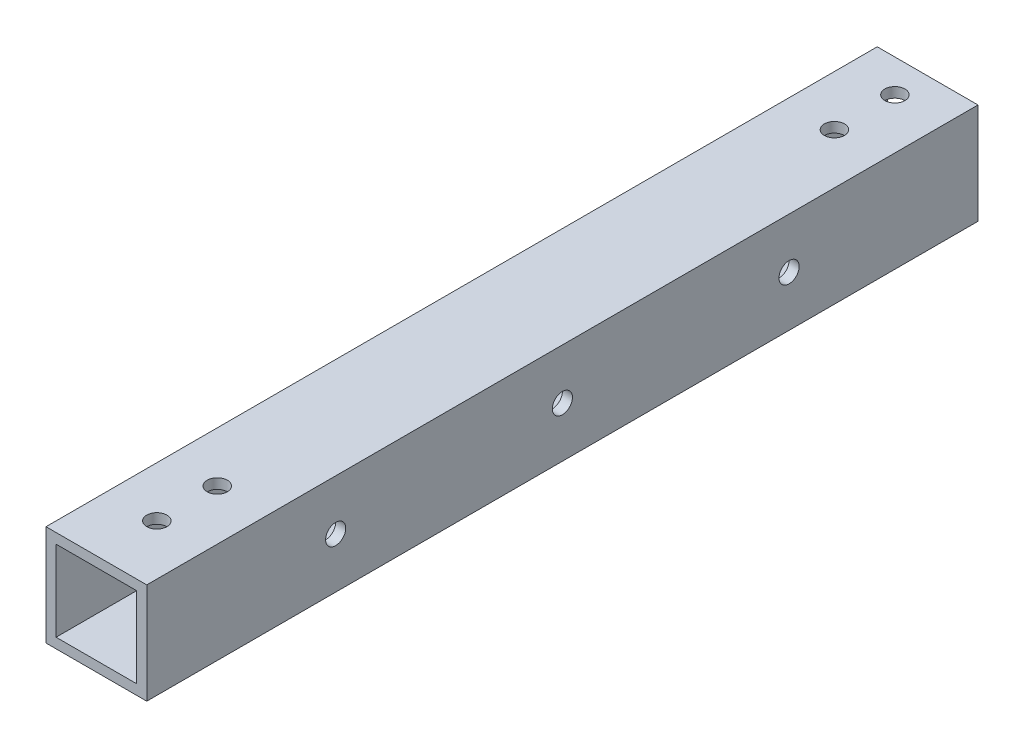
ISO-10303-21;
HEADER;
FILE_DESCRIPTION(('STEP AP214'),'2;1');
FILE_NAME('part.step','',(''),(''),'','','');
FILE_SCHEMA(('AUTOMOTIVE_DESIGN { 1 0 10303 214 1 1 1 1 }'));
ENDSEC;
DATA;
#1=APPLICATION_CONTEXT('core data for automotive mechanical design processes');
#2=APPLICATION_PROTOCOL_DEFINITION('international standard','automotive_design',2000,#1);
#3=PRODUCT_CONTEXT('',#1,'mechanical');
#4=PRODUCT('Part','Part','',(#3));
#5=PRODUCT_RELATED_PRODUCT_CATEGORY('part','',(#4));
#6=PRODUCT_DEFINITION_FORMATION('','',#4);
#7=PRODUCT_DEFINITION_CONTEXT('part definition',#1,'design');
#8=PRODUCT_DEFINITION('design','',#6,#7);
#9=PRODUCT_DEFINITION_SHAPE('','',#8);
#10=(LENGTH_UNIT() NAMED_UNIT(*) SI_UNIT(.MILLI.,.METRE.));
#11=(NAMED_UNIT(*) PLANE_ANGLE_UNIT() SI_UNIT($,.RADIAN.));
#12=(NAMED_UNIT(*) SI_UNIT($,.STERADIAN.) SOLID_ANGLE_UNIT());
#13=UNCERTAINTY_MEASURE_WITH_UNIT(LENGTH_MEASURE(1.E-05),#10,'distance_accuracy_value','');
#14=(GEOMETRIC_REPRESENTATION_CONTEXT(3) GLOBAL_UNCERTAINTY_ASSIGNED_CONTEXT((#13)) GLOBAL_UNIT_ASSIGNED_CONTEXT((#10,
#11,#12)) REPRESENTATION_CONTEXT('',''));
#15=CARTESIAN_POINT('',(0.,0.,0.));
#16=DIRECTION('',(0.,0.,1.));
#17=DIRECTION('',(1.,0.,0.));
#18=AXIS2_PLACEMENT_3D('',#15,#16,#17);
#19=CARTESIAN_POINT('',(0.,0.,165.));
#20=DIRECTION('',(0.,0.,1.));
#21=DIRECTION('',(1.,0.,0.));
#22=AXIS2_PLACEMENT_3D('',#19,#20,#21);
#23=PLANE('',#22);
#24=DIRECTION('',(0.,1.,0.));
#25=VECTOR('',#24,1.);
#26=CARTESIAN_POINT('',(10.,10.,165.));
#27=LINE('',#26,#25);
#28=CARTESIAN_POINT('',(10.,-10.,165.));
#29=VERTEX_POINT('',#28);
#30=CARTESIAN_POINT('',(10.,10.,165.));
#31=VERTEX_POINT('',#30);
#32=EDGE_CURVE('E140',#29,#31,#27,.T.);
#33=ORIENTED_EDGE('',*,*,#32,.T.);
#34=DIRECTION('',(-1.,0.,0.));
#35=VECTOR('',#34,1.);
#36=CARTESIAN_POINT('',(-10.,10.,165.));
#37=LINE('',#36,#35);
#38=CARTESIAN_POINT('',(-10.,10.,165.));
#39=VERTEX_POINT('',#38);
#40=EDGE_CURVE('E143',#31,#39,#37,.T.);
#41=ORIENTED_EDGE('',*,*,#40,.T.);
#42=DIRECTION('',(0.,-1.,0.));
#43=VECTOR('',#42,1.);
#44=CARTESIAN_POINT('',(-10.,10.,165.));
#45=LINE('',#44,#43);
#46=CARTESIAN_POINT('',(-9.99999999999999,-10.,165.));
#47=VERTEX_POINT('',#46);
#48=EDGE_CURVE('E146',#39,#47,#45,.T.);
#49=ORIENTED_EDGE('',*,*,#48,.T.);
#50=DIRECTION('',(1.,0.,0.));
#51=VECTOR('',#50,1.);
#52=CARTESIAN_POINT('',(-9.99999999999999,-10.,165.));
#53=LINE('',#52,#51);
#54=EDGE_CURVE('E148',#47,#29,#53,.T.);
#55=ORIENTED_EDGE('',*,*,#54,.T.);
#56=EDGE_LOOP('',(#33,#41,#49,#55));
#57=FACE_BOUND('',#56,.T.);
#58=DIRECTION('',(1.,0.,0.));
#59=VECTOR('',#58,1.);
#60=CARTESIAN_POINT('',(-8.,-8.,165.));
#61=LINE('',#60,#59);
#62=CARTESIAN_POINT('',(-8.,-8.,165.));
#63=VERTEX_POINT('',#62);
#64=CARTESIAN_POINT('',(8.,-8.,165.));
#65=VERTEX_POINT('',#64);
#66=EDGE_CURVE('E110',#63,#65,#61,.T.);
#67=ORIENTED_EDGE('',*,*,#66,.F.);
#68=DIRECTION('',(0.,-1.,0.));
#69=VECTOR('',#68,1.);
#70=CARTESIAN_POINT('',(-8.,8.,165.));
#71=LINE('',#70,#69);
#72=CARTESIAN_POINT('',(-8.,8.,165.));
#73=VERTEX_POINT('',#72);
#74=EDGE_CURVE('E102',#73,#63,#71,.T.);
#75=ORIENTED_EDGE('',*,*,#74,.F.);
#76=DIRECTION('',(-1.,0.,0.));
#77=VECTOR('',#76,1.);
#78=CARTESIAN_POINT('',(-8.,8.,165.));
#79=LINE('',#78,#77);
#80=CARTESIAN_POINT('',(8.,8.,165.));
#81=VERTEX_POINT('',#80);
#82=EDGE_CURVE('E124',#81,#73,#79,.T.);
#83=ORIENTED_EDGE('',*,*,#82,.F.);
#84=DIRECTION('',(0.,1.,0.));
#85=VECTOR('',#84,1.);
#86=CARTESIAN_POINT('',(8.,8.,165.));
#87=LINE('',#86,#85);
#88=EDGE_CURVE('E122',#65,#81,#87,.T.);
#89=ORIENTED_EDGE('',*,*,#88,.F.);
#90=EDGE_LOOP('',(#67,#75,#83,#89));
#91=FACE_BOUND('',#90,.T.);
#92=ADVANCED_FACE('F35',(#57,#91),#23,.T.);
#93=CARTESIAN_POINT('',(0.,0.,0.));
#94=DIRECTION('',(0.,0.,1.));
#95=DIRECTION('',(1.,0.,0.));
#96=AXIS2_PLACEMENT_3D('',#93,#94,#95);
#97=PLANE('',#96);
#98=DIRECTION('',(0.,1.,0.));
#99=VECTOR('',#98,1.);
#100=CARTESIAN_POINT('',(10.,10.,0.));
#101=LINE('',#100,#99);
#102=CARTESIAN_POINT('',(10.,-10.,0.));
#103=VERTEX_POINT('',#102);
#104=CARTESIAN_POINT('',(10.,10.,0.));
#105=VERTEX_POINT('',#104);
#106=EDGE_CURVE('E118',#103,#105,#101,.T.);
#107=ORIENTED_EDGE('',*,*,#106,.F.);
#108=DIRECTION('',(1.,0.,0.));
#109=VECTOR('',#108,1.);
#110=CARTESIAN_POINT('',(-9.99999999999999,-10.,0.));
#111=LINE('',#110,#109);
#112=CARTESIAN_POINT('',(-9.99999999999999,-10.,0.));
#113=VERTEX_POINT('',#112);
#114=EDGE_CURVE('E144',#113,#103,#111,.T.);
#115=ORIENTED_EDGE('',*,*,#114,.F.);
#116=DIRECTION('',(0.,-1.,0.));
#117=VECTOR('',#116,1.);
#118=CARTESIAN_POINT('',(-10.,10.,0.));
#119=LINE('',#118,#117);
#120=CARTESIAN_POINT('',(-10.,10.,0.));
#121=VERTEX_POINT('',#120);
#122=EDGE_CURVE('E155',#121,#113,#119,.T.);
#123=ORIENTED_EDGE('',*,*,#122,.F.);
#124=DIRECTION('',(-1.,0.,0.));
#125=VECTOR('',#124,1.);
#126=CARTESIAN_POINT('',(-10.,10.,0.));
#127=LINE('',#126,#125);
#128=EDGE_CURVE('E153',#105,#121,#127,.T.);
#129=ORIENTED_EDGE('',*,*,#128,.F.);
#130=EDGE_LOOP('',(#107,#115,#123,#129));
#131=FACE_BOUND('',#130,.T.);
#132=DIRECTION('',(0.,-1.,0.));
#133=VECTOR('',#132,1.);
#134=CARTESIAN_POINT('',(-8.,8.,0.));
#135=LINE('',#134,#133);
#136=CARTESIAN_POINT('',(-8.,8.,0.));
#137=VERTEX_POINT('',#136);
#138=CARTESIAN_POINT('',(-8.,-8.,0.));
#139=VERTEX_POINT('',#138);
#140=EDGE_CURVE('E60',#137,#139,#135,.T.);
#141=ORIENTED_EDGE('',*,*,#140,.T.);
#142=DIRECTION('',(1.,0.,0.));
#143=VECTOR('',#142,1.);
#144=CARTESIAN_POINT('',(-8.,-8.,0.));
#145=LINE('',#144,#143);
#146=CARTESIAN_POINT('',(8.,-8.,0.));
#147=VERTEX_POINT('',#146);
#148=EDGE_CURVE('E117',#139,#147,#145,.T.);
#149=ORIENTED_EDGE('',*,*,#148,.T.);
#150=DIRECTION('',(0.,1.,0.));
#151=VECTOR('',#150,1.);
#152=CARTESIAN_POINT('',(8.,8.,0.));
#153=LINE('',#152,#151);
#154=CARTESIAN_POINT('',(8.,8.,0.));
#155=VERTEX_POINT('',#154);
#156=EDGE_CURVE('E132',#147,#155,#153,.T.);
#157=ORIENTED_EDGE('',*,*,#156,.T.);
#158=DIRECTION('',(-1.,0.,0.));
#159=VECTOR('',#158,1.);
#160=CARTESIAN_POINT('',(-8.,8.,0.));
#161=LINE('',#160,#159);
#162=EDGE_CURVE('E111',#155,#137,#161,.T.);
#163=ORIENTED_EDGE('',*,*,#162,.T.);
#164=EDGE_LOOP('',(#141,#149,#157,#163));
#165=FACE_BOUND('',#164,.T.);
#166=ADVANCED_FACE('F263',(#131,#165),#97,.F.);
#167=CARTESIAN_POINT('',(10.,10.,165.));
#168=DIRECTION('',(-1.,0.,0.));
#169=DIRECTION('',(0.,-1.,0.));
#170=AXIS2_PLACEMENT_3D('',#167,#168,#169);
#171=PLANE('',#170);
#172=CARTESIAN_POINT('',(10.,0.,37.4999999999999));
#173=DIRECTION('',(-1.,0.,0.));
#174=DIRECTION('',(0.,0.,1.));
#175=AXIS2_PLACEMENT_3D('',#172,#173,#174);
#176=CIRCLE('',#175,2.);
#177=CARTESIAN_POINT('',(10.,0.,39.4999999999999));
#178=VERTEX_POINT('',#177);
#179=EDGE_CURVE('E361',#178,#178,#176,.T.);
#180=ORIENTED_EDGE('',*,*,#179,.T.);
#181=EDGE_LOOP('',(#180));
#182=FACE_BOUND('',#181,.T.);
#183=CARTESIAN_POINT('',(10.,0.,82.5));
#184=DIRECTION('',(-1.,0.,0.));
#185=DIRECTION('',(0.,0.,1.));
#186=AXIS2_PLACEMENT_3D('',#183,#184,#185);
#187=CIRCLE('',#186,2.);
#188=CARTESIAN_POINT('',(10.,0.,84.5));
#189=VERTEX_POINT('',#188);
#190=EDGE_CURVE('E191',#189,#189,#187,.T.);
#191=ORIENTED_EDGE('',*,*,#190,.T.);
#192=EDGE_LOOP('',(#191));
#193=FACE_BOUND('',#192,.T.);
#194=CARTESIAN_POINT('',(10.,0.,127.5));
#195=DIRECTION('',(-1.,0.,0.));
#196=DIRECTION('',(0.,0.,1.));
#197=AXIS2_PLACEMENT_3D('',#194,#195,#196);
#198=CIRCLE('',#197,2.);
#199=CARTESIAN_POINT('',(10.,0.,129.5));
#200=VERTEX_POINT('',#199);
#201=EDGE_CURVE('E187',#200,#200,#198,.T.);
#202=ORIENTED_EDGE('',*,*,#201,.T.);
#203=EDGE_LOOP('',(#202));
#204=FACE_BOUND('',#203,.T.);
#205=ORIENTED_EDGE('',*,*,#106,.T.);
#206=DIRECTION('',(0.,0.,-1.));
#207=VECTOR('',#206,1.);
#208=CARTESIAN_POINT('',(10.,10.,165.));
#209=LINE('',#208,#207);
#210=EDGE_CURVE('E11',#31,#105,#209,.T.);
#211=ORIENTED_EDGE('',*,*,#210,.F.);
#212=ORIENTED_EDGE('',*,*,#32,.F.);
#213=DIRECTION('',(0.,0.,-1.));
#214=VECTOR('',#213,1.);
#215=CARTESIAN_POINT('',(10.,-10.,165.));
#216=LINE('',#215,#214);
#217=EDGE_CURVE('E150',#29,#103,#216,.T.);
#218=ORIENTED_EDGE('',*,*,#217,.T.);
#219=EDGE_LOOP('',(#205,#211,#212,#218));
#220=FACE_BOUND('',#219,.T.);
#221=ADVANCED_FACE('F37',(#182,#193,#204,#220),#171,.F.);
#222=CARTESIAN_POINT('',(-10.,10.,165.));
#223=DIRECTION('',(0.,-1.,0.));
#224=DIRECTION('',(0.,0.,-1.));
#225=AXIS2_PLACEMENT_3D('',#222,#223,#224);
#226=PLANE('',#225);
#227=CARTESIAN_POINT('',(0.,10.,153.));
#228=DIRECTION('',(0.,1.,0.));
#229=DIRECTION('',(0.,0.,1.));
#230=AXIS2_PLACEMENT_3D('',#227,#228,#229);
#231=CIRCLE('',#230,2.);
#232=CARTESIAN_POINT('',(0.,10.,155.));
#233=VERTEX_POINT('',#232);
#234=EDGE_CURVE('E213',#233,#233,#231,.T.);
#235=ORIENTED_EDGE('',*,*,#234,.F.);
#236=EDGE_LOOP('',(#235));
#237=FACE_BOUND('',#236,.T.);
#238=CARTESIAN_POINT('',(0.,10.,141.));
#239=DIRECTION('',(0.,1.,0.));
#240=DIRECTION('',(0.,0.,1.));
#241=AXIS2_PLACEMENT_3D('',#238,#239,#240);
#242=CIRCLE('',#241,2.);
#243=CARTESIAN_POINT('',(0.,10.,143.));
#244=VERTEX_POINT('',#243);
#245=EDGE_CURVE('E220',#244,#244,#242,.T.);
#246=ORIENTED_EDGE('',*,*,#245,.F.);
#247=EDGE_LOOP('',(#246));
#248=FACE_BOUND('',#247,.T.);
#249=CARTESIAN_POINT('',(0.,10.,18.5));
#250=DIRECTION('',(0.,1.,0.));
#251=DIRECTION('',(0.,0.,1.));
#252=AXIS2_PLACEMENT_3D('',#249,#250,#251);
#253=CIRCLE('',#252,2.);
#254=CARTESIAN_POINT('',(0.,10.,20.5));
#255=VERTEX_POINT('',#254);
#256=EDGE_CURVE('E227',#255,#255,#253,.T.);
#257=ORIENTED_EDGE('',*,*,#256,.F.);
#258=EDGE_LOOP('',(#257));
#259=FACE_BOUND('',#258,.T.);
#260=CARTESIAN_POINT('',(0.,10.,6.5));
#261=DIRECTION('',(0.,1.,0.));
#262=DIRECTION('',(0.,0.,1.));
#263=AXIS2_PLACEMENT_3D('',#260,#261,#262);
#264=CIRCLE('',#263,2.);
#265=CARTESIAN_POINT('',(0.,10.,8.5));
#266=VERTEX_POINT('',#265);
#267=EDGE_CURVE('E234',#266,#266,#264,.T.);
#268=ORIENTED_EDGE('',*,*,#267,.F.);
#269=EDGE_LOOP('',(#268));
#270=FACE_BOUND('',#269,.T.);
#271=ORIENTED_EDGE('',*,*,#128,.T.);
#272=DIRECTION('',(0.,0.,-1.));
#273=VECTOR('',#272,1.);
#274=CARTESIAN_POINT('',(-10.,10.,165.));
#275=LINE('',#274,#273);
#276=EDGE_CURVE('E44',#39,#121,#275,.T.);
#277=ORIENTED_EDGE('',*,*,#276,.F.);
#278=ORIENTED_EDGE('',*,*,#40,.F.);
#279=ORIENTED_EDGE('',*,*,#210,.T.);
#280=EDGE_LOOP('',(#271,#277,#278,#279));
#281=FACE_BOUND('',#280,.T.);
#282=ADVANCED_FACE('F277',(#237,#248,#259,#270,#281),#226,.F.);
#283=CARTESIAN_POINT('',(-10.,10.,165.));
#284=DIRECTION('',(1.,0.,0.));
#285=DIRECTION('',(0.,1.,0.));
#286=AXIS2_PLACEMENT_3D('',#283,#284,#285);
#287=PLANE('',#286);
#288=CARTESIAN_POINT('',(-10.,0.,37.4999999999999));
#289=DIRECTION('',(-1.,0.,0.));
#290=DIRECTION('',(0.,0.,1.));
#291=AXIS2_PLACEMENT_3D('',#288,#289,#290);
#292=CIRCLE('',#291,1.99999999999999);
#293=CARTESIAN_POINT('',(-10.,0.,39.4999999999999));
#294=VERTEX_POINT('',#293);
#295=EDGE_CURVE('E362',#294,#294,#292,.T.);
#296=ORIENTED_EDGE('',*,*,#295,.F.);
#297=EDGE_LOOP('',(#296));
#298=FACE_BOUND('',#297,.T.);
#299=CARTESIAN_POINT('',(-10.,0.,82.5));
#300=DIRECTION('',(-1.,0.,0.));
#301=DIRECTION('',(0.,0.,1.));
#302=AXIS2_PLACEMENT_3D('',#299,#300,#301);
#303=CIRCLE('',#302,1.99999999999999);
#304=CARTESIAN_POINT('',(-10.,0.,84.4999999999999));
#305=VERTEX_POINT('',#304);
#306=EDGE_CURVE('E198',#305,#305,#303,.T.);
#307=ORIENTED_EDGE('',*,*,#306,.F.);
#308=EDGE_LOOP('',(#307));
#309=FACE_BOUND('',#308,.T.);
#310=CARTESIAN_POINT('',(-10.,0.,127.5));
#311=DIRECTION('',(-1.,0.,0.));
#312=DIRECTION('',(0.,0.,1.));
#313=AXIS2_PLACEMENT_3D('',#310,#311,#312);
#314=CIRCLE('',#313,1.99999999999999);
#315=CARTESIAN_POINT('',(-10.,0.,129.5));
#316=VERTEX_POINT('',#315);
#317=EDGE_CURVE('E195',#316,#316,#314,.T.);
#318=ORIENTED_EDGE('',*,*,#317,.F.);
#319=EDGE_LOOP('',(#318));
#320=FACE_BOUND('',#319,.T.);
#321=ORIENTED_EDGE('',*,*,#122,.T.);
#322=DIRECTION('',(0.,0.,-1.));
#323=VECTOR('',#322,1.);
#324=CARTESIAN_POINT('',(-9.99999999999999,-10.,165.));
#325=LINE('',#324,#323);
#326=EDGE_CURVE('E160',#47,#113,#325,.T.);
#327=ORIENTED_EDGE('',*,*,#326,.F.);
#328=ORIENTED_EDGE('',*,*,#48,.F.);
#329=ORIENTED_EDGE('',*,*,#276,.T.);
#330=EDGE_LOOP('',(#321,#327,#328,#329));
#331=FACE_BOUND('',#330,.T.);
#332=ADVANCED_FACE('F274',(#298,#309,#320,#331),#287,.F.);
#333=CARTESIAN_POINT('',(-9.99999999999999,-10.,165.));
#334=DIRECTION('',(0.,1.,0.));
#335=DIRECTION('',(0.,0.,1.));
#336=AXIS2_PLACEMENT_3D('',#333,#334,#335);
#337=PLANE('',#336);
#338=CARTESIAN_POINT('',(0.,-10.,153.));
#339=DIRECTION('',(0.,1.,0.));
#340=DIRECTION('',(0.,0.,1.));
#341=AXIS2_PLACEMENT_3D('',#338,#339,#340);
#342=CIRCLE('',#341,2.);
#343=CARTESIAN_POINT('',(0.,-10.,155.));
#344=VERTEX_POINT('',#343);
#345=EDGE_CURVE('E183',#344,#344,#342,.T.);
#346=ORIENTED_EDGE('',*,*,#345,.T.);
#347=EDGE_LOOP('',(#346));
#348=FACE_BOUND('',#347,.T.);
#349=CARTESIAN_POINT('',(0.,-10.,141.));
#350=DIRECTION('',(0.,1.,0.));
#351=DIRECTION('',(0.,0.,1.));
#352=AXIS2_PLACEMENT_3D('',#349,#350,#351);
#353=CIRCLE('',#352,2.);
#354=CARTESIAN_POINT('',(0.,-10.,143.));
#355=VERTEX_POINT('',#354);
#356=EDGE_CURVE('E178',#355,#355,#353,.T.);
#357=ORIENTED_EDGE('',*,*,#356,.T.);
#358=EDGE_LOOP('',(#357));
#359=FACE_BOUND('',#358,.T.);
#360=CARTESIAN_POINT('',(0.,-10.,18.5));
#361=DIRECTION('',(0.,1.,0.));
#362=DIRECTION('',(0.,0.,1.));
#363=AXIS2_PLACEMENT_3D('',#360,#361,#362);
#364=CIRCLE('',#363,2.);
#365=CARTESIAN_POINT('',(0.,-10.,20.5));
#366=VERTEX_POINT('',#365);
#367=EDGE_CURVE('E173',#366,#366,#364,.T.);
#368=ORIENTED_EDGE('',*,*,#367,.T.);
#369=EDGE_LOOP('',(#368));
#370=FACE_BOUND('',#369,.T.);
#371=CARTESIAN_POINT('',(0.,-10.,6.5));
#372=DIRECTION('',(0.,1.,0.));
#373=DIRECTION('',(0.,0.,1.));
#374=AXIS2_PLACEMENT_3D('',#371,#372,#373);
#375=CIRCLE('',#374,2.);
#376=CARTESIAN_POINT('',(0.,-10.,8.49999999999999));
#377=VERTEX_POINT('',#376);
#378=EDGE_CURVE('E168',#377,#377,#375,.T.);
#379=ORIENTED_EDGE('',*,*,#378,.T.);
#380=EDGE_LOOP('',(#379));
#381=FACE_BOUND('',#380,.T.);
#382=ORIENTED_EDGE('',*,*,#114,.T.);
#383=ORIENTED_EDGE('',*,*,#217,.F.);
#384=ORIENTED_EDGE('',*,*,#54,.F.);
#385=ORIENTED_EDGE('',*,*,#326,.T.);
#386=EDGE_LOOP('',(#382,#383,#384,#385));
#387=FACE_BOUND('',#386,.T.);
#388=ADVANCED_FACE('F257',(#348,#359,#370,#381,#387),#337,.F.);
#389=CARTESIAN_POINT('',(-8.,8.,165.));
#390=DIRECTION('',(1.,0.,0.));
#391=DIRECTION('',(0.,0.,-1.));
#392=AXIS2_PLACEMENT_3D('',#389,#390,#391);
#393=PLANE('',#392);
#394=CARTESIAN_POINT('',(-8.,0.,37.4999999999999));
#395=DIRECTION('',(1.,0.,0.));
#396=DIRECTION('',(0.,0.,-1.));
#397=AXIS2_PLACEMENT_3D('',#394,#395,#396);
#398=CIRCLE('',#397,1.99999999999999);
#399=CARTESIAN_POINT('',(-8.,0.,35.4999999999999));
#400=VERTEX_POINT('',#399);
#401=EDGE_CURVE('E203',#400,#400,#398,.T.);
#402=ORIENTED_EDGE('',*,*,#401,.F.);
#403=EDGE_LOOP('',(#402));
#404=FACE_BOUND('',#403,.T.);
#405=CARTESIAN_POINT('',(-8.,0.,82.5));
#406=DIRECTION('',(1.,0.,0.));
#407=DIRECTION('',(0.,0.,-1.));
#408=AXIS2_PLACEMENT_3D('',#405,#406,#407);
#409=CIRCLE('',#408,1.99999999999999);
#410=CARTESIAN_POINT('',(-8.,0.,80.5));
#411=VERTEX_POINT('',#410);
#412=EDGE_CURVE('E190',#411,#411,#409,.T.);
#413=ORIENTED_EDGE('',*,*,#412,.F.);
#414=EDGE_LOOP('',(#413));
#415=FACE_BOUND('',#414,.T.);
#416=CARTESIAN_POINT('',(-8.,0.,127.5));
#417=DIRECTION('',(1.,0.,0.));
#418=DIRECTION('',(0.,0.,-1.));
#419=AXIS2_PLACEMENT_3D('',#416,#417,#418);
#420=CIRCLE('',#419,1.99999999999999);
#421=CARTESIAN_POINT('',(-8.,0.,125.5));
#422=VERTEX_POINT('',#421);
#423=EDGE_CURVE('E186',#422,#422,#420,.T.);
#424=ORIENTED_EDGE('',*,*,#423,.F.);
#425=EDGE_LOOP('',(#424));
#426=FACE_BOUND('',#425,.T.);
#427=ORIENTED_EDGE('',*,*,#140,.F.);
#428=DIRECTION('',(0.,0.,-1.));
#429=VECTOR('',#428,1.);
#430=CARTESIAN_POINT('',(-8.,8.,165.));
#431=LINE('',#430,#429);
#432=EDGE_CURVE('E106',#73,#137,#431,.T.);
#433=ORIENTED_EDGE('',*,*,#432,.F.);
#434=ORIENTED_EDGE('',*,*,#74,.T.);
#435=DIRECTION('',(0.,0.,-1.));
#436=VECTOR('',#435,1.);
#437=CARTESIAN_POINT('',(-8.,-8.,165.));
#438=LINE('',#437,#436);
#439=EDGE_CURVE('E105',#63,#139,#438,.T.);
#440=ORIENTED_EDGE('',*,*,#439,.T.);
#441=EDGE_LOOP('',(#427,#433,#434,#440));
#442=FACE_BOUND('',#441,.T.);
#443=ADVANCED_FACE('F104',(#404,#415,#426,#442),#393,.T.);
#444=CARTESIAN_POINT('',(-8.,-8.,165.));
#445=DIRECTION('',(0.,1.,0.));
#446=DIRECTION('',(-1.,0.,0.));
#447=AXIS2_PLACEMENT_3D('',#444,#445,#446);
#448=PLANE('',#447);
#449=CARTESIAN_POINT('',(0.,-8.,153.));
#450=DIRECTION('',(0.,1.,0.));
#451=DIRECTION('',(-1.,0.,0.));
#452=AXIS2_PLACEMENT_3D('',#449,#450,#451);
#453=CIRCLE('',#452,2.);
#454=CARTESIAN_POINT('',(-2.,-8.,153.));
#455=VERTEX_POINT('',#454);
#456=EDGE_CURVE('E182',#455,#455,#453,.T.);
#457=ORIENTED_EDGE('',*,*,#456,.F.);
#458=EDGE_LOOP('',(#457));
#459=FACE_BOUND('',#458,.T.);
#460=CARTESIAN_POINT('',(0.,-8.,141.));
#461=DIRECTION('',(0.,1.,0.));
#462=DIRECTION('',(-1.,0.,0.));
#463=AXIS2_PLACEMENT_3D('',#460,#461,#462);
#464=CIRCLE('',#463,2.);
#465=CARTESIAN_POINT('',(-2.,-8.,141.));
#466=VERTEX_POINT('',#465);
#467=EDGE_CURVE('E177',#466,#466,#464,.T.);
#468=ORIENTED_EDGE('',*,*,#467,.F.);
#469=EDGE_LOOP('',(#468));
#470=FACE_BOUND('',#469,.T.);
#471=CARTESIAN_POINT('',(0.,-8.,18.5));
#472=DIRECTION('',(0.,1.,0.));
#473=DIRECTION('',(-1.,0.,0.));
#474=AXIS2_PLACEMENT_3D('',#471,#472,#473);
#475=CIRCLE('',#474,2.);
#476=CARTESIAN_POINT('',(-2.,-8.,18.5));
#477=VERTEX_POINT('',#476);
#478=EDGE_CURVE('E169',#477,#477,#475,.T.);
#479=ORIENTED_EDGE('',*,*,#478,.F.);
#480=EDGE_LOOP('',(#479));
#481=FACE_BOUND('',#480,.T.);
#482=CARTESIAN_POINT('',(0.,-8.,6.5));
#483=DIRECTION('',(0.,1.,0.));
#484=DIRECTION('',(-1.,0.,0.));
#485=AXIS2_PLACEMENT_3D('',#482,#483,#484);
#486=CIRCLE('',#485,2.);
#487=CARTESIAN_POINT('',(-2.,-8.,6.5));
#488=VERTEX_POINT('',#487);
#489=EDGE_CURVE('E130',#488,#488,#486,.T.);
#490=ORIENTED_EDGE('',*,*,#489,.F.);
#491=EDGE_LOOP('',(#490));
#492=FACE_BOUND('',#491,.T.);
#493=ORIENTED_EDGE('',*,*,#148,.F.);
#494=ORIENTED_EDGE('',*,*,#439,.F.);
#495=ORIENTED_EDGE('',*,*,#66,.T.);
#496=DIRECTION('',(0.,0.,-1.));
#497=VECTOR('',#496,1.);
#498=CARTESIAN_POINT('',(8.,-8.,165.));
#499=LINE('',#498,#497);
#500=EDGE_CURVE('E119',#65,#147,#499,.T.);
#501=ORIENTED_EDGE('',*,*,#500,.T.);
#502=EDGE_LOOP('',(#493,#494,#495,#501));
#503=FACE_BOUND('',#502,.T.);
#504=ADVANCED_FACE('F114',(#459,#470,#481,#492,#503),#448,.T.);
#505=CARTESIAN_POINT('',(8.,8.,165.));
#506=DIRECTION('',(-1.,0.,0.));
#507=DIRECTION('',(0.,0.,1.));
#508=AXIS2_PLACEMENT_3D('',#505,#506,#507);
#509=PLANE('',#508);
#510=CARTESIAN_POINT('',(8.,0.,37.4999999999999));
#511=DIRECTION('',(-1.,0.,0.));
#512=DIRECTION('',(0.,0.,1.));
#513=AXIS2_PLACEMENT_3D('',#510,#511,#512);
#514=CIRCLE('',#513,1.99999999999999);
#515=CARTESIAN_POINT('',(8.,0.,39.4999999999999));
#516=VERTEX_POINT('',#515);
#517=EDGE_CURVE('E39',#516,#516,#514,.T.);
#518=ORIENTED_EDGE('',*,*,#517,.F.);
#519=EDGE_LOOP('',(#518));
#520=FACE_BOUND('',#519,.T.);
#521=CARTESIAN_POINT('',(8.,0.,82.5));
#522=DIRECTION('',(-1.,0.,0.));
#523=DIRECTION('',(0.,0.,1.));
#524=AXIS2_PLACEMENT_3D('',#521,#522,#523);
#525=CIRCLE('',#524,1.99999999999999);
#526=CARTESIAN_POINT('',(8.,0.,84.4999999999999));
#527=VERTEX_POINT('',#526);
#528=EDGE_CURVE('E188',#527,#527,#525,.T.);
#529=ORIENTED_EDGE('',*,*,#528,.F.);
#530=EDGE_LOOP('',(#529));
#531=FACE_BOUND('',#530,.T.);
#532=CARTESIAN_POINT('',(8.,0.,127.5));
#533=DIRECTION('',(-1.,0.,0.));
#534=DIRECTION('',(0.,0.,1.));
#535=AXIS2_PLACEMENT_3D('',#532,#533,#534);
#536=CIRCLE('',#535,1.99999999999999);
#537=CARTESIAN_POINT('',(8.,0.,129.5));
#538=VERTEX_POINT('',#537);
#539=EDGE_CURVE('E184',#538,#538,#536,.T.);
#540=ORIENTED_EDGE('',*,*,#539,.F.);
#541=EDGE_LOOP('',(#540));
#542=FACE_BOUND('',#541,.T.);
#543=ORIENTED_EDGE('',*,*,#156,.F.);
#544=ORIENTED_EDGE('',*,*,#500,.F.);
#545=ORIENTED_EDGE('',*,*,#88,.T.);
#546=DIRECTION('',(0.,0.,-1.));
#547=VECTOR('',#546,1.);
#548=CARTESIAN_POINT('',(8.,8.,165.));
#549=LINE('',#548,#547);
#550=EDGE_CURVE('E52',#81,#155,#549,.T.);
#551=ORIENTED_EDGE('',*,*,#550,.T.);
#552=EDGE_LOOP('',(#543,#544,#545,#551));
#553=FACE_BOUND('',#552,.T.);
#554=ADVANCED_FACE('F245',(#520,#531,#542,#553),#509,.T.);
#555=CARTESIAN_POINT('',(-8.,8.,165.));
#556=DIRECTION('',(0.,-1.,0.));
#557=DIRECTION('',(0.,0.,-1.));
#558=AXIS2_PLACEMENT_3D('',#555,#556,#557);
#559=PLANE('',#558);
#560=CARTESIAN_POINT('',(0.,8.,153.));
#561=DIRECTION('',(0.,-1.,0.));
#562=DIRECTION('',(0.,0.,-1.));
#563=AXIS2_PLACEMENT_3D('',#560,#561,#562);
#564=CIRCLE('',#563,2.);
#565=CARTESIAN_POINT('',(0.,8.,151.));
#566=VERTEX_POINT('',#565);
#567=EDGE_CURVE('E179',#566,#566,#564,.T.);
#568=ORIENTED_EDGE('',*,*,#567,.F.);
#569=EDGE_LOOP('',(#568));
#570=FACE_BOUND('',#569,.T.);
#571=CARTESIAN_POINT('',(0.,8.,141.));
#572=DIRECTION('',(0.,-1.,0.));
#573=DIRECTION('',(0.,0.,-1.));
#574=AXIS2_PLACEMENT_3D('',#571,#572,#573);
#575=CIRCLE('',#574,2.);
#576=CARTESIAN_POINT('',(0.,8.,139.));
#577=VERTEX_POINT('',#576);
#578=EDGE_CURVE('E174',#577,#577,#575,.T.);
#579=ORIENTED_EDGE('',*,*,#578,.F.);
#580=EDGE_LOOP('',(#579));
#581=FACE_BOUND('',#580,.T.);
#582=CARTESIAN_POINT('',(0.,8.,18.5));
#583=DIRECTION('',(0.,-1.,0.));
#584=DIRECTION('',(0.,0.,-1.));
#585=AXIS2_PLACEMENT_3D('',#582,#583,#584);
#586=CIRCLE('',#585,2.);
#587=CARTESIAN_POINT('',(0.,8.,16.5));
#588=VERTEX_POINT('',#587);
#589=EDGE_CURVE('E172',#588,#588,#586,.T.);
#590=ORIENTED_EDGE('',*,*,#589,.F.);
#591=EDGE_LOOP('',(#590));
#592=FACE_BOUND('',#591,.T.);
#593=CARTESIAN_POINT('',(0.,8.,6.5));
#594=DIRECTION('',(0.,-1.,0.));
#595=DIRECTION('',(0.,0.,-1.));
#596=AXIS2_PLACEMENT_3D('',#593,#594,#595);
#597=CIRCLE('',#596,2.);
#598=CARTESIAN_POINT('',(0.,8.,4.5));
#599=VERTEX_POINT('',#598);
#600=EDGE_CURVE('E165',#599,#599,#597,.T.);
#601=ORIENTED_EDGE('',*,*,#600,.F.);
#602=EDGE_LOOP('',(#601));
#603=FACE_BOUND('',#602,.T.);
#604=ORIENTED_EDGE('',*,*,#162,.F.);
#605=ORIENTED_EDGE('',*,*,#550,.F.);
#606=ORIENTED_EDGE('',*,*,#82,.T.);
#607=ORIENTED_EDGE('',*,*,#432,.T.);
#608=EDGE_LOOP('',(#604,#605,#606,#607));
#609=FACE_BOUND('',#608,.T.);
#610=ADVANCED_FACE('F253',(#570,#581,#592,#603,#609),#559,.T.);
#611=CARTESIAN_POINT('',(0.,10.,6.5));
#612=DIRECTION('',(0.,1.,0.));
#613=DIRECTION('',(0.,0.,1.));
#614=AXIS2_PLACEMENT_3D('',#611,#612,#613);
#615=CYLINDRICAL_SURFACE('',#614,2.);
#616=ORIENTED_EDGE('',*,*,#600,.T.);
#617=EDGE_LOOP('',(#616));
#618=FACE_BOUND('',#617,.T.);
#619=ORIENTED_EDGE('',*,*,#267,.T.);
#620=EDGE_LOOP('',(#619));
#621=FACE_BOUND('',#620,.T.);
#622=ADVANCED_FACE('F311',(#618,#621),#615,.F.);
#623=ORIENTED_EDGE('',*,*,#489,.T.);
#624=EDGE_LOOP('',(#623));
#625=FACE_BOUND('',#624,.T.);
#626=ORIENTED_EDGE('',*,*,#378,.F.);
#627=EDGE_LOOP('',(#626));
#628=FACE_BOUND('',#627,.T.);
#629=ADVANCED_FACE('F241',(#625,#628),#615,.F.);
#630=CARTESIAN_POINT('',(0.,10.,18.5));
#631=DIRECTION('',(0.,1.,0.));
#632=DIRECTION('',(0.,0.,1.));
#633=AXIS2_PLACEMENT_3D('',#630,#631,#632);
#634=CYLINDRICAL_SURFACE('',#633,2.);
#635=ORIENTED_EDGE('',*,*,#478,.T.);
#636=EDGE_LOOP('',(#635));
#637=FACE_BOUND('',#636,.T.);
#638=ORIENTED_EDGE('',*,*,#367,.F.);
#639=EDGE_LOOP('',(#638));
#640=FACE_BOUND('',#639,.T.);
#641=ADVANCED_FACE('F322',(#637,#640),#634,.F.);
#642=ORIENTED_EDGE('',*,*,#589,.T.);
#643=EDGE_LOOP('',(#642));
#644=FACE_BOUND('',#643,.T.);
#645=ORIENTED_EDGE('',*,*,#256,.T.);
#646=EDGE_LOOP('',(#645));
#647=FACE_BOUND('',#646,.T.);
#648=ADVANCED_FACE('F325',(#644,#647),#634,.F.);
#649=CARTESIAN_POINT('',(0.,10.,141.));
#650=DIRECTION('',(0.,1.,0.));
#651=DIRECTION('',(0.,0.,1.));
#652=AXIS2_PLACEMENT_3D('',#649,#650,#651);
#653=CYLINDRICAL_SURFACE('',#652,2.);
#654=ORIENTED_EDGE('',*,*,#578,.T.);
#655=EDGE_LOOP('',(#654));
#656=FACE_BOUND('',#655,.T.);
#657=ORIENTED_EDGE('',*,*,#245,.T.);
#658=EDGE_LOOP('',(#657));
#659=FACE_BOUND('',#658,.T.);
#660=ADVANCED_FACE('F327',(#656,#659),#653,.F.);
#661=ORIENTED_EDGE('',*,*,#467,.T.);
#662=EDGE_LOOP('',(#661));
#663=FACE_BOUND('',#662,.T.);
#664=ORIENTED_EDGE('',*,*,#356,.F.);
#665=EDGE_LOOP('',(#664));
#666=FACE_BOUND('',#665,.T.);
#667=ADVANCED_FACE('F330',(#663,#666),#653,.F.);
#668=CARTESIAN_POINT('',(0.,10.,153.));
#669=DIRECTION('',(0.,1.,0.));
#670=DIRECTION('',(0.,0.,1.));
#671=AXIS2_PLACEMENT_3D('',#668,#669,#670);
#672=CYLINDRICAL_SURFACE('',#671,2.);
#673=ORIENTED_EDGE('',*,*,#567,.T.);
#674=EDGE_LOOP('',(#673));
#675=FACE_BOUND('',#674,.T.);
#676=ORIENTED_EDGE('',*,*,#234,.T.);
#677=EDGE_LOOP('',(#676));
#678=FACE_BOUND('',#677,.T.);
#679=ADVANCED_FACE('F332',(#675,#678),#672,.F.);
#680=ORIENTED_EDGE('',*,*,#456,.T.);
#681=EDGE_LOOP('',(#680));
#682=FACE_BOUND('',#681,.T.);
#683=ORIENTED_EDGE('',*,*,#345,.F.);
#684=EDGE_LOOP('',(#683));
#685=FACE_BOUND('',#684,.T.);
#686=ADVANCED_FACE('F335',(#682,#685),#672,.F.);
#687=CARTESIAN_POINT('',(-9.99999999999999,0.,127.5));
#688=DIRECTION('',(-1.,0.,0.));
#689=DIRECTION('',(0.,0.,1.));
#690=AXIS2_PLACEMENT_3D('',#687,#688,#689);
#691=CYLINDRICAL_SURFACE('',#690,1.99999999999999);
#692=ORIENTED_EDGE('',*,*,#539,.T.);
#693=EDGE_LOOP('',(#692));
#694=FACE_BOUND('',#693,.T.);
#695=ORIENTED_EDGE('',*,*,#201,.F.);
#696=EDGE_LOOP('',(#695));
#697=FACE_BOUND('',#696,.T.);
#698=ADVANCED_FACE('F337',(#694,#697),#691,.F.);
#699=ORIENTED_EDGE('',*,*,#423,.T.);
#700=EDGE_LOOP('',(#699));
#701=FACE_BOUND('',#700,.T.);
#702=ORIENTED_EDGE('',*,*,#317,.T.);
#703=EDGE_LOOP('',(#702));
#704=FACE_BOUND('',#703,.T.);
#705=ADVANCED_FACE('F340',(#701,#704),#691,.F.);
#706=CARTESIAN_POINT('',(-9.99999999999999,0.,82.5));
#707=DIRECTION('',(-1.,0.,0.));
#708=DIRECTION('',(0.,0.,1.));
#709=AXIS2_PLACEMENT_3D('',#706,#707,#708);
#710=CYLINDRICAL_SURFACE('',#709,1.99999999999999);
#711=ORIENTED_EDGE('',*,*,#528,.T.);
#712=EDGE_LOOP('',(#711));
#713=FACE_BOUND('',#712,.T.);
#714=ORIENTED_EDGE('',*,*,#190,.F.);
#715=EDGE_LOOP('',(#714));
#716=FACE_BOUND('',#715,.T.);
#717=ADVANCED_FACE('F342',(#713,#716),#710,.F.);
#718=ORIENTED_EDGE('',*,*,#412,.T.);
#719=EDGE_LOOP('',(#718));
#720=FACE_BOUND('',#719,.T.);
#721=ORIENTED_EDGE('',*,*,#306,.T.);
#722=EDGE_LOOP('',(#721));
#723=FACE_BOUND('',#722,.T.);
#724=ADVANCED_FACE('F345',(#720,#723),#710,.F.);
#725=CARTESIAN_POINT('',(-9.99999999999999,0.,37.4999999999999));
#726=DIRECTION('',(-1.,0.,0.));
#727=DIRECTION('',(0.,0.,1.));
#728=AXIS2_PLACEMENT_3D('',#725,#726,#727);
#729=CYLINDRICAL_SURFACE('',#728,1.99999999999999);
#730=ORIENTED_EDGE('',*,*,#517,.T.);
#731=EDGE_LOOP('',(#730));
#732=FACE_BOUND('',#731,.T.);
#733=ORIENTED_EDGE('',*,*,#179,.F.);
#734=EDGE_LOOP('',(#733));
#735=FACE_BOUND('',#734,.T.);
#736=ADVANCED_FACE('F346',(#732,#735),#729,.F.);
#737=ORIENTED_EDGE('',*,*,#401,.T.);
#738=EDGE_LOOP('',(#737));
#739=FACE_BOUND('',#738,.T.);
#740=ORIENTED_EDGE('',*,*,#295,.T.);
#741=EDGE_LOOP('',(#740));
#742=FACE_BOUND('',#741,.T.);
#743=ADVANCED_FACE('F348',(#739,#742),#729,.F.);
#744=CLOSED_SHELL('',(#92,#166,#221,#282,#332,#388,#443,#504,#554,#610,#622,#629,#641,#648,#660,
#667,#679,#686,#698,#705,#717,#724,#736,#743));
#745=MANIFOLD_SOLID_BREP('B2',#744);
#746=ADVANCED_BREP_SHAPE_REPRESENTATION('',(#18,#745),#14);
#747=SHAPE_DEFINITION_REPRESENTATION(#9,#746);
ENDSEC;
END-ISO-10303-21;
